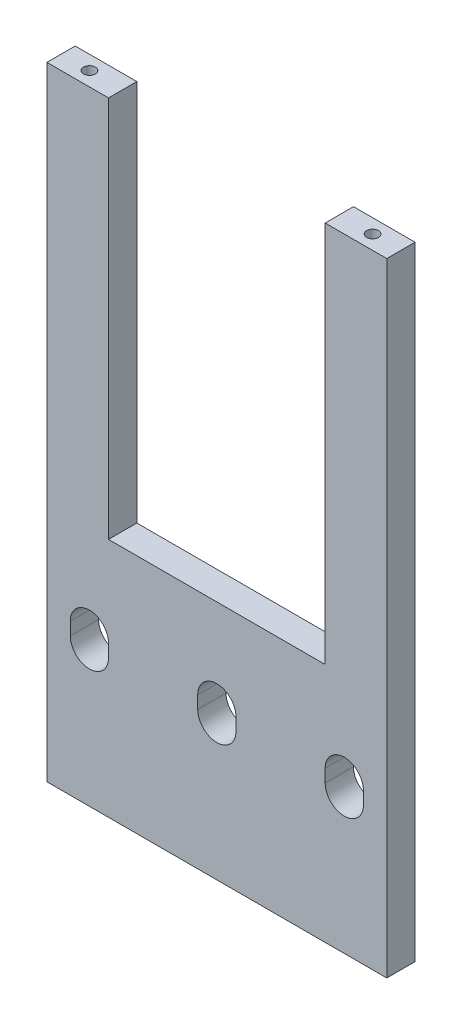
ISO-10303-21;
HEADER;
FILE_DESCRIPTION(('STEP AP214'),'2;1');
FILE_NAME('part.step','',(''),(''),'','','');
FILE_SCHEMA(('AUTOMOTIVE_DESIGN { 1 0 10303 214 1 1 1 1 }'));
ENDSEC;
DATA;
#1=APPLICATION_CONTEXT('core data for automotive mechanical design processes');
#2=APPLICATION_PROTOCOL_DEFINITION('international standard','automotive_design',2000,#1);
#3=PRODUCT_CONTEXT('',#1,'mechanical');
#4=PRODUCT('Part','Part','',(#3));
#5=PRODUCT_RELATED_PRODUCT_CATEGORY('part','',(#4));
#6=PRODUCT_DEFINITION_FORMATION('','',#4);
#7=PRODUCT_DEFINITION_CONTEXT('part definition',#1,'design');
#8=PRODUCT_DEFINITION('design','',#6,#7);
#9=PRODUCT_DEFINITION_SHAPE('','',#8);
#10=(LENGTH_UNIT() NAMED_UNIT(*) SI_UNIT(.MILLI.,.METRE.));
#11=(NAMED_UNIT(*) PLANE_ANGLE_UNIT() SI_UNIT($,.RADIAN.));
#12=(NAMED_UNIT(*) SI_UNIT($,.STERADIAN.) SOLID_ANGLE_UNIT());
#13=UNCERTAINTY_MEASURE_WITH_UNIT(LENGTH_MEASURE(1.E-05),#10,'distance_accuracy_value','');
#14=(GEOMETRIC_REPRESENTATION_CONTEXT(3) GLOBAL_UNCERTAINTY_ASSIGNED_CONTEXT((#13)) GLOBAL_UNIT_ASSIGNED_CONTEXT((#10,
#11,#12)) REPRESENTATION_CONTEXT('',''));
#15=CARTESIAN_POINT('',(0.,0.,0.));
#16=DIRECTION('',(0.,0.,1.));
#17=DIRECTION('',(1.,0.,0.));
#18=AXIS2_PLACEMENT_3D('',#15,#16,#17);
#19=CARTESIAN_POINT('',(60.,110.,10.));
#20=DIRECTION('',(0.,-1.,0.));
#21=DIRECTION('',(1.,0.,0.));
#22=AXIS2_PLACEMENT_3D('',#19,#20,#21);
#23=PLANE('',#22);
#24=CARTESIAN_POINT('',(-50.,110.,5.));
#25=DIRECTION('',(0.,1.,0.));
#26=DIRECTION('',(0.,0.,1.));
#27=AXIS2_PLACEMENT_3D('',#24,#25,#26);
#28=CIRCLE('',#27,2.1);
#29=CARTESIAN_POINT('',(-50.,110.,7.1));
#30=VERTEX_POINT('',#29);
#31=EDGE_CURVE('E436',#30,#30,#28,.T.);
#32=ORIENTED_EDGE('',*,*,#31,.F.);
#33=EDGE_LOOP('',(#32));
#34=FACE_BOUND('',#33,.T.);
#35=DIRECTION('',(-1.,0.,0.));
#36=VECTOR('',#35,1.);
#37=CARTESIAN_POINT('',(60.,110.,10.));
#38=LINE('',#37,#36);
#39=CARTESIAN_POINT('',(-38.25,110.,10.));
#40=VERTEX_POINT('',#39);
#41=CARTESIAN_POINT('',(-60.,110.,10.));
#42=VERTEX_POINT('',#41);
#43=EDGE_CURVE('E571',#40,#42,#38,.T.);
#44=ORIENTED_EDGE('',*,*,#43,.F.);
#45=DIRECTION('',(0.,0.,1.));
#46=VECTOR('',#45,1.);
#47=CARTESIAN_POINT('',(-38.25,110.,0.));
#48=LINE('',#47,#46);
#49=CARTESIAN_POINT('',(-38.25,110.,0.));
#50=VERTEX_POINT('',#49);
#51=EDGE_CURVE('E464',#50,#40,#48,.T.);
#52=ORIENTED_EDGE('',*,*,#51,.F.);
#53=DIRECTION('',(-1.,0.,0.));
#54=VECTOR('',#53,1.);
#55=CARTESIAN_POINT('',(60.,110.,0.));
#56=LINE('',#55,#54);
#57=CARTESIAN_POINT('',(-60.,110.,0.));
#58=VERTEX_POINT('',#57);
#59=EDGE_CURVE('E582',#50,#58,#56,.T.);
#60=ORIENTED_EDGE('',*,*,#59,.T.);
#61=DIRECTION('',(0.,0.,-1.));
#62=VECTOR('',#61,1.);
#63=CARTESIAN_POINT('',(-60.,110.,10.));
#64=LINE('',#63,#62);
#65=EDGE_CURVE('E575',#42,#58,#64,.T.);
#66=ORIENTED_EDGE('',*,*,#65,.F.);
#67=EDGE_LOOP('',(#44,#52,#60,#66));
#68=FACE_BOUND('',#67,.T.);
#69=ADVANCED_FACE('F259',(#34,#68),#23,.F.);
#70=CARTESIAN_POINT('',(0.,0.,10.));
#71=DIRECTION('',(0.,0.,-1.));
#72=DIRECTION('',(-1.,0.,0.));
#73=AXIS2_PLACEMENT_3D('',#70,#71,#72);
#74=PLANE('',#73);
#75=DIRECTION('',(1.,0.,0.));
#76=VECTOR('',#75,1.);
#77=CARTESIAN_POINT('',(-38.25,-25.,10.));
#78=LINE('',#77,#76);
#79=CARTESIAN_POINT('',(-38.25,-25.,10.));
#80=VERTEX_POINT('',#79);
#81=CARTESIAN_POINT('',(38.25,-25.,10.));
#82=VERTEX_POINT('',#81);
#83=EDGE_CURVE('E460',#80,#82,#78,.T.);
#84=ORIENTED_EDGE('',*,*,#83,.F.);
#85=DIRECTION('',(0.,-1.,0.));
#86=VECTOR('',#85,1.);
#87=CARTESIAN_POINT('',(-38.25,110.,10.));
#88=LINE('',#87,#86);
#89=EDGE_CURVE('E448',#40,#80,#88,.T.);
#90=ORIENTED_EDGE('',*,*,#89,.F.);
#91=ORIENTED_EDGE('',*,*,#43,.T.);
#92=DIRECTION('',(0.,-1.,0.));
#93=VECTOR('',#92,1.);
#94=CARTESIAN_POINT('',(-60.,110.,10.));
#95=LINE('',#94,#93);
#96=CARTESIAN_POINT('',(-60.,-110.,10.));
#97=VERTEX_POINT('',#96);
#98=EDGE_CURVE('E563',#42,#97,#95,.T.);
#99=ORIENTED_EDGE('',*,*,#98,.T.);
#100=DIRECTION('',(1.,0.,0.));
#101=VECTOR('',#100,1.);
#102=CARTESIAN_POINT('',(60.,-110.,10.));
#103=LINE('',#102,#101);
#104=CARTESIAN_POINT('',(60.,-110.,10.));
#105=VERTEX_POINT('',#104);
#106=EDGE_CURVE('E566',#97,#105,#103,.T.);
#107=ORIENTED_EDGE('',*,*,#106,.T.);
#108=DIRECTION('',(0.,1.,0.));
#109=VECTOR('',#108,1.);
#110=CARTESIAN_POINT('',(60.,110.,10.));
#111=LINE('',#110,#109);
#112=CARTESIAN_POINT('',(60.,110.,10.));
#113=VERTEX_POINT('',#112);
#114=EDGE_CURVE('E569',#105,#113,#111,.T.);
#115=ORIENTED_EDGE('',*,*,#114,.T.);
#116=CARTESIAN_POINT('',(38.25,110.,10.));
#117=VERTEX_POINT('',#116);
#118=EDGE_CURVE('E572',#113,#117,#38,.T.);
#119=ORIENTED_EDGE('',*,*,#118,.T.);
#120=DIRECTION('',(0.,1.,0.));
#121=VECTOR('',#120,1.);
#122=CARTESIAN_POINT('',(38.25,110.,10.));
#123=LINE('',#122,#121);
#124=EDGE_CURVE('E453',#82,#117,#123,.T.);
#125=ORIENTED_EDGE('',*,*,#124,.F.);
#126=EDGE_LOOP('',(#84,#90,#91,#99,#107,#115,#119,#125));
#127=FACE_BOUND('',#126,.T.);
#128=CARTESIAN_POINT('',(0.,-61.25,10.));
#129=DIRECTION('',(0.,0.,1.));
#130=DIRECTION('',(1.,0.,0.));
#131=AXIS2_PLACEMENT_3D('',#128,#129,#130);
#132=CIRCLE('',#131,6.75);
#133=CARTESIAN_POINT('',(-6.75000000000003,-61.25,10.));
#134=VERTEX_POINT('',#133);
#135=CARTESIAN_POINT('',(6.75000000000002,-61.25,10.));
#136=VERTEX_POINT('',#135);
#137=EDGE_CURVE('E544',#134,#136,#132,.T.);
#138=ORIENTED_EDGE('',*,*,#137,.F.);
#139=DIRECTION('',(0.,1.,0.));
#140=VECTOR('',#139,1.);
#141=CARTESIAN_POINT('',(-6.74999999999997,-61.25,10.));
#142=LINE('',#141,#140);
#143=CARTESIAN_POINT('',(-6.74999999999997,-56.75,10.));
#144=VERTEX_POINT('',#143);
#145=EDGE_CURVE('E538',#134,#144,#142,.T.);
#146=ORIENTED_EDGE('',*,*,#145,.T.);
#147=CARTESIAN_POINT('',(0.,-56.75,10.));
#148=DIRECTION('',(0.,0.,1.));
#149=DIRECTION('',(1.,0.,0.));
#150=AXIS2_PLACEMENT_3D('',#147,#148,#149);
#151=CIRCLE('',#150,6.75);
#152=CARTESIAN_POINT('',(6.75000000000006,-56.75,10.));
#153=VERTEX_POINT('',#152);
#154=EDGE_CURVE('E554',#153,#144,#151,.T.);
#155=ORIENTED_EDGE('',*,*,#154,.F.);
#156=DIRECTION('',(0.,1.,0.));
#157=VECTOR('',#156,1.);
#158=CARTESIAN_POINT('',(6.75000000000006,-61.25,10.));
#159=LINE('',#158,#157);
#160=EDGE_CURVE('E531',#136,#153,#159,.T.);
#161=ORIENTED_EDGE('',*,*,#160,.F.);
#162=EDGE_LOOP('',(#138,#146,#155,#161));
#163=FACE_BOUND('',#162,.T.);
#164=DIRECTION('',(0.,1.,0.));
#165=VECTOR('',#164,1.);
#166=CARTESIAN_POINT('',(38.25,-61.25,10.));
#167=LINE('',#166,#165);
#168=CARTESIAN_POINT('',(38.25,-61.25,10.));
#169=VERTEX_POINT('',#168);
#170=CARTESIAN_POINT('',(38.25,-56.75,10.));
#171=VERTEX_POINT('',#170);
#172=EDGE_CURVE('E507',#169,#171,#167,.T.);
#173=ORIENTED_EDGE('',*,*,#172,.T.);
#174=CARTESIAN_POINT('',(45.,-56.75,10.));
#175=DIRECTION('',(0.,0.,1.));
#176=DIRECTION('',(1.,0.,0.));
#177=AXIS2_PLACEMENT_3D('',#174,#175,#176);
#178=CIRCLE('',#177,6.75);
#179=CARTESIAN_POINT('',(51.75,-56.75,10.));
#180=VERTEX_POINT('',#179);
#181=EDGE_CURVE('E523',#180,#171,#178,.T.);
#182=ORIENTED_EDGE('',*,*,#181,.F.);
#183=DIRECTION('',(0.,1.,0.));
#184=VECTOR('',#183,1.);
#185=CARTESIAN_POINT('',(51.75,-61.25,10.));
#186=LINE('',#185,#184);
#187=CARTESIAN_POINT('',(51.75,-61.25,10.));
#188=VERTEX_POINT('',#187);
#189=EDGE_CURVE('E500',#188,#180,#186,.T.);
#190=ORIENTED_EDGE('',*,*,#189,.F.);
#191=CARTESIAN_POINT('',(45.,-61.25,10.));
#192=DIRECTION('',(0.,0.,1.));
#193=DIRECTION('',(1.,0.,0.));
#194=AXIS2_PLACEMENT_3D('',#191,#192,#193);
#195=CIRCLE('',#194,6.75);
#196=EDGE_CURVE('E513',#169,#188,#195,.T.);
#197=ORIENTED_EDGE('',*,*,#196,.F.);
#198=EDGE_LOOP('',(#173,#182,#190,#197));
#199=FACE_BOUND('',#198,.T.);
#200=CARTESIAN_POINT('',(-45.,-56.75,10.));
#201=DIRECTION('',(0.,0.,1.));
#202=DIRECTION('',(1.,0.,0.));
#203=AXIS2_PLACEMENT_3D('',#200,#201,#202);
#204=CIRCLE('',#203,6.75);
#205=CARTESIAN_POINT('',(-38.25,-56.75,10.));
#206=VERTEX_POINT('',#205);
#207=CARTESIAN_POINT('',(-51.75,-56.75,10.));
#208=VERTEX_POINT('',#207);
#209=EDGE_CURVE('E492',#206,#208,#204,.T.);
#210=ORIENTED_EDGE('',*,*,#209,.F.);
#211=DIRECTION('',(0.,1.,0.));
#212=VECTOR('',#211,1.);
#213=CARTESIAN_POINT('',(-38.25,-61.25,10.));
#214=LINE('',#213,#212);
#215=CARTESIAN_POINT('',(-38.25,-61.25,10.));
#216=VERTEX_POINT('',#215);
#217=EDGE_CURVE('E466',#216,#206,#214,.T.);
#218=ORIENTED_EDGE('',*,*,#217,.F.);
#219=CARTESIAN_POINT('',(-45.,-61.25,10.));
#220=DIRECTION('',(0.,0.,1.));
#221=DIRECTION('',(1.,0.,0.));
#222=AXIS2_PLACEMENT_3D('',#219,#220,#221);
#223=CIRCLE('',#222,6.75);
#224=CARTESIAN_POINT('',(-51.7499999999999,-61.25,10.));
#225=VERTEX_POINT('',#224);
#226=EDGE_CURVE('E483',#225,#216,#223,.T.);
#227=ORIENTED_EDGE('',*,*,#226,.F.);
#228=DIRECTION('',(0.,1.,0.));
#229=VECTOR('',#228,1.);
#230=CARTESIAN_POINT('',(-51.75,-61.25,10.));
#231=LINE('',#230,#229);
#232=EDGE_CURVE('E479',#225,#208,#231,.T.);
#233=ORIENTED_EDGE('',*,*,#232,.T.);
#234=EDGE_LOOP('',(#210,#218,#227,#233));
#235=FACE_BOUND('',#234,.T.);
#236=ADVANCED_FACE('F608',(#127,#163,#199,#235),#74,.F.);
#237=CARTESIAN_POINT('',(-60.,110.,10.));
#238=DIRECTION('',(1.,0.,0.));
#239=DIRECTION('',(0.,1.,0.));
#240=AXIS2_PLACEMENT_3D('',#237,#238,#239);
#241=PLANE('',#240);
#242=DIRECTION('',(0.,-1.,0.));
#243=VECTOR('',#242,1.);
#244=CARTESIAN_POINT('',(-60.,110.,0.));
#245=LINE('',#244,#243);
#246=CARTESIAN_POINT('',(-60.,-110.,0.));
#247=VERTEX_POINT('',#246);
#248=EDGE_CURVE('E562',#58,#247,#245,.T.);
#249=ORIENTED_EDGE('',*,*,#248,.T.);
#250=DIRECTION('',(0.,0.,-1.));
#251=VECTOR('',#250,1.);
#252=CARTESIAN_POINT('',(-60.,-110.,10.));
#253=LINE('',#252,#251);
#254=EDGE_CURVE('E13',#97,#247,#253,.T.);
#255=ORIENTED_EDGE('',*,*,#254,.F.);
#256=ORIENTED_EDGE('',*,*,#98,.F.);
#257=ORIENTED_EDGE('',*,*,#65,.T.);
#258=EDGE_LOOP('',(#249,#255,#256,#257));
#259=FACE_BOUND('',#258,.T.);
#260=ADVANCED_FACE('F261',(#259),#241,.F.);
#261=CARTESIAN_POINT('',(60.,-110.,10.));
#262=DIRECTION('',(0.,1.,0.));
#263=DIRECTION('',(0.,0.,1.));
#264=AXIS2_PLACEMENT_3D('',#261,#262,#263);
#265=PLANE('',#264);
#266=CARTESIAN_POINT('',(-50.,-110.,5.));
#267=DIRECTION('',(0.,-1.,0.));
#268=DIRECTION('',(0.,0.,-1.));
#269=AXIS2_PLACEMENT_3D('',#266,#267,#268);
#270=CIRCLE('',#269,2.1);
#271=CARTESIAN_POINT('',(-50.,-110.,2.9));
#272=VERTEX_POINT('',#271);
#273=EDGE_CURVE('E420',#272,#272,#270,.T.);
#274=ORIENTED_EDGE('',*,*,#273,.F.);
#275=EDGE_LOOP('',(#274));
#276=FACE_BOUND('',#275,.T.);
#277=CARTESIAN_POINT('',(40.,-110.,5.));
#278=DIRECTION('',(0.,-1.,0.));
#279=DIRECTION('',(0.,0.,-1.));
#280=AXIS2_PLACEMENT_3D('',#277,#278,#279);
#281=CIRCLE('',#280,2.1);
#282=CARTESIAN_POINT('',(40.,-110.,2.9));
#283=VERTEX_POINT('',#282);
#284=EDGE_CURVE('E419',#283,#283,#281,.T.);
#285=ORIENTED_EDGE('',*,*,#284,.F.);
#286=EDGE_LOOP('',(#285));
#287=FACE_BOUND('',#286,.T.);
#288=CARTESIAN_POINT('',(0.,-110.,5.));
#289=DIRECTION('',(0.,-1.,0.));
#290=DIRECTION('',(0.,0.,-1.));
#291=AXIS2_PLACEMENT_3D('',#288,#289,#290);
#292=CIRCLE('',#291,2.1);
#293=CARTESIAN_POINT('',(0.,-110.,2.9));
#294=VERTEX_POINT('',#293);
#295=EDGE_CURVE('E430',#294,#294,#292,.T.);
#296=ORIENTED_EDGE('',*,*,#295,.F.);
#297=EDGE_LOOP('',(#296));
#298=FACE_BOUND('',#297,.T.);
#299=DIRECTION('',(1.,0.,0.));
#300=VECTOR('',#299,1.);
#301=CARTESIAN_POINT('',(60.,-110.,0.));
#302=LINE('',#301,#300);
#303=CARTESIAN_POINT('',(60.,-110.,0.));
#304=VERTEX_POINT('',#303);
#305=EDGE_CURVE('E578',#247,#304,#302,.T.);
#306=ORIENTED_EDGE('',*,*,#305,.T.);
#307=DIRECTION('',(0.,0.,-1.));
#308=VECTOR('',#307,1.);
#309=CARTESIAN_POINT('',(60.,-110.,10.));
#310=LINE('',#309,#308);
#311=EDGE_CURVE('E267',#105,#304,#310,.T.);
#312=ORIENTED_EDGE('',*,*,#311,.F.);
#313=ORIENTED_EDGE('',*,*,#106,.F.);
#314=ORIENTED_EDGE('',*,*,#254,.T.);
#315=EDGE_LOOP('',(#306,#312,#313,#314));
#316=FACE_BOUND('',#315,.T.);
#317=ADVANCED_FACE('F612',(#276,#287,#298,#316),#265,.F.);
#318=CARTESIAN_POINT('',(60.,110.,10.));
#319=DIRECTION('',(-1.,0.,0.));
#320=DIRECTION('',(0.,-1.,0.));
#321=AXIS2_PLACEMENT_3D('',#318,#319,#320);
#322=PLANE('',#321);
#323=DIRECTION('',(0.,1.,0.));
#324=VECTOR('',#323,1.);
#325=CARTESIAN_POINT('',(60.,110.,0.));
#326=LINE('',#325,#324);
#327=CARTESIAN_POINT('',(60.,110.,0.));
#328=VERTEX_POINT('',#327);
#329=EDGE_CURVE('E580',#304,#328,#326,.T.);
#330=ORIENTED_EDGE('',*,*,#329,.T.);
#331=DIRECTION('',(0.,0.,-1.));
#332=VECTOR('',#331,1.);
#333=CARTESIAN_POINT('',(60.,110.,10.));
#334=LINE('',#333,#332);
#335=EDGE_CURVE('E587',#113,#328,#334,.T.);
#336=ORIENTED_EDGE('',*,*,#335,.F.);
#337=ORIENTED_EDGE('',*,*,#114,.F.);
#338=ORIENTED_EDGE('',*,*,#311,.T.);
#339=EDGE_LOOP('',(#330,#336,#337,#338));
#340=FACE_BOUND('',#339,.T.);
#341=ADVANCED_FACE('F594',(#340),#322,.F.);
#342=CARTESIAN_POINT('',(50.,110.,5.));
#343=DIRECTION('',(0.,1.,0.));
#344=DIRECTION('',(0.,0.,1.));
#345=AXIS2_PLACEMENT_3D('',#342,#343,#344);
#346=CIRCLE('',#345,2.1);
#347=CARTESIAN_POINT('',(50.,110.,7.1));
#348=VERTEX_POINT('',#347);
#349=EDGE_CURVE('E442',#348,#348,#346,.T.);
#350=ORIENTED_EDGE('',*,*,#349,.F.);
#351=EDGE_LOOP('',(#350));
#352=FACE_BOUND('',#351,.T.);
#353=CARTESIAN_POINT('',(38.25,110.,0.));
#354=VERTEX_POINT('',#353);
#355=EDGE_CURVE('E567',#328,#354,#56,.T.);
#356=ORIENTED_EDGE('',*,*,#355,.T.);
#357=DIRECTION('',(0.,0.,1.));
#358=VECTOR('',#357,1.);
#359=CARTESIAN_POINT('',(38.25,110.,0.));
#360=LINE('',#359,#358);
#361=EDGE_CURVE('E467',#354,#117,#360,.T.);
#362=ORIENTED_EDGE('',*,*,#361,.T.);
#363=ORIENTED_EDGE('',*,*,#118,.F.);
#364=ORIENTED_EDGE('',*,*,#335,.T.);
#365=EDGE_LOOP('',(#356,#362,#363,#364));
#366=FACE_BOUND('',#365,.T.);
#367=ADVANCED_FACE('F603',(#352,#366),#23,.F.);
#368=CARTESIAN_POINT('',(0.,0.,0.));
#369=DIRECTION('',(0.,0.,-1.));
#370=DIRECTION('',(-1.,0.,0.));
#371=AXIS2_PLACEMENT_3D('',#368,#369,#370);
#372=PLANE('',#371);
#373=DIRECTION('',(0.,-1.,0.));
#374=VECTOR('',#373,1.);
#375=CARTESIAN_POINT('',(-38.25,110.,0.));
#376=LINE('',#375,#374);
#377=CARTESIAN_POINT('',(-38.25,-25.,0.));
#378=VERTEX_POINT('',#377);
#379=EDGE_CURVE('E449',#50,#378,#376,.T.);
#380=ORIENTED_EDGE('',*,*,#379,.T.);
#381=DIRECTION('',(1.,0.,0.));
#382=VECTOR('',#381,1.);
#383=CARTESIAN_POINT('',(-38.25,-25.,0.));
#384=LINE('',#383,#382);
#385=CARTESIAN_POINT('',(38.25,-25.,0.));
#386=VERTEX_POINT('',#385);
#387=EDGE_CURVE('E452',#378,#386,#384,.T.);
#388=ORIENTED_EDGE('',*,*,#387,.T.);
#389=DIRECTION('',(0.,1.,0.));
#390=VECTOR('',#389,1.);
#391=CARTESIAN_POINT('',(38.25,110.,0.));
#392=LINE('',#391,#390);
#393=EDGE_CURVE('E274',#386,#354,#392,.T.);
#394=ORIENTED_EDGE('',*,*,#393,.T.);
#395=ORIENTED_EDGE('',*,*,#355,.F.);
#396=ORIENTED_EDGE('',*,*,#329,.F.);
#397=ORIENTED_EDGE('',*,*,#305,.F.);
#398=ORIENTED_EDGE('',*,*,#248,.F.);
#399=ORIENTED_EDGE('',*,*,#59,.F.);
#400=EDGE_LOOP('',(#380,#388,#394,#395,#396,#397,#398,#399));
#401=FACE_BOUND('',#400,.T.);
#402=DIRECTION('',(0.,1.,0.));
#403=VECTOR('',#402,1.);
#404=CARTESIAN_POINT('',(-51.75,-61.25,0.));
#405=LINE('',#404,#403);
#406=CARTESIAN_POINT('',(-51.75,-61.25,0.));
#407=VERTEX_POINT('',#406);
#408=CARTESIAN_POINT('',(-51.75,-56.75,0.));
#409=VERTEX_POINT('',#408);
#410=EDGE_CURVE('E477',#407,#409,#405,.T.);
#411=ORIENTED_EDGE('',*,*,#410,.F.);
#412=CARTESIAN_POINT('',(-45.,-61.25,0.));
#413=DIRECTION('',(0.,0.,1.));
#414=DIRECTION('',(1.,0.,0.));
#415=AXIS2_PLACEMENT_3D('',#412,#413,#414);
#416=CIRCLE('',#415,6.75);
#417=CARTESIAN_POINT('',(-38.25,-61.25,0.));
#418=VERTEX_POINT('',#417);
#419=EDGE_CURVE('E485',#407,#418,#416,.T.);
#420=ORIENTED_EDGE('',*,*,#419,.T.);
#421=DIRECTION('',(0.,1.,0.));
#422=VECTOR('',#421,1.);
#423=CARTESIAN_POINT('',(-38.25,-61.25,0.));
#424=LINE('',#423,#422);
#425=CARTESIAN_POINT('',(-38.25,-56.75,0.));
#426=VERTEX_POINT('',#425);
#427=EDGE_CURVE('E474',#418,#426,#424,.T.);
#428=ORIENTED_EDGE('',*,*,#427,.T.);
#429=CARTESIAN_POINT('',(-45.,-56.75,0.));
#430=DIRECTION('',(0.,0.,1.));
#431=DIRECTION('',(1.,0.,0.));
#432=AXIS2_PLACEMENT_3D('',#429,#430,#431);
#433=CIRCLE('',#432,6.75);
#434=EDGE_CURVE('E495',#426,#409,#433,.T.);
#435=ORIENTED_EDGE('',*,*,#434,.T.);
#436=EDGE_LOOP('',(#411,#420,#428,#435));
#437=FACE_BOUND('',#436,.T.);
#438=DIRECTION('',(0.,1.,0.));
#439=VECTOR('',#438,1.);
#440=CARTESIAN_POINT('',(38.25,-61.25,0.));
#441=LINE('',#440,#439);
#442=CARTESIAN_POINT('',(38.25,-61.25,0.));
#443=VERTEX_POINT('',#442);
#444=CARTESIAN_POINT('',(38.25,-56.75,0.));
#445=VERTEX_POINT('',#444);
#446=EDGE_CURVE('E505',#443,#445,#441,.T.);
#447=ORIENTED_EDGE('',*,*,#446,.F.);
#448=CARTESIAN_POINT('',(45.,-61.25,0.));
#449=DIRECTION('',(0.,0.,1.));
#450=DIRECTION('',(1.,0.,0.));
#451=AXIS2_PLACEMENT_3D('',#448,#449,#450);
#452=CIRCLE('',#451,6.75);
#453=CARTESIAN_POINT('',(51.75,-61.25,0.));
#454=VERTEX_POINT('',#453);
#455=EDGE_CURVE('E516',#443,#454,#452,.T.);
#456=ORIENTED_EDGE('',*,*,#455,.T.);
#457=DIRECTION('',(0.,1.,0.));
#458=VECTOR('',#457,1.);
#459=CARTESIAN_POINT('',(51.75,-61.25,0.));
#460=LINE('',#459,#458);
#461=CARTESIAN_POINT('',(51.75,-56.75,0.));
#462=VERTEX_POINT('',#461);
#463=EDGE_CURVE('E502',#454,#462,#460,.T.);
#464=ORIENTED_EDGE('',*,*,#463,.T.);
#465=CARTESIAN_POINT('',(45.,-56.75,0.));
#466=DIRECTION('',(0.,0.,1.));
#467=DIRECTION('',(1.,0.,0.));
#468=AXIS2_PLACEMENT_3D('',#465,#466,#467);
#469=CIRCLE('',#468,6.75);
#470=EDGE_CURVE('E526',#462,#445,#469,.T.);
#471=ORIENTED_EDGE('',*,*,#470,.T.);
#472=EDGE_LOOP('',(#447,#456,#464,#471));
#473=FACE_BOUND('',#472,.T.);
#474=CARTESIAN_POINT('',(0.,-56.75,0.));
#475=DIRECTION('',(0.,0.,1.));
#476=DIRECTION('',(1.,0.,0.));
#477=AXIS2_PLACEMENT_3D('',#474,#475,#476);
#478=CIRCLE('',#477,6.75);
#479=CARTESIAN_POINT('',(6.75000000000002,-56.75,0.));
#480=VERTEX_POINT('',#479);
#481=CARTESIAN_POINT('',(-6.74999999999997,-56.75,0.));
#482=VERTEX_POINT('',#481);
#483=EDGE_CURVE('E557',#480,#482,#478,.T.);
#484=ORIENTED_EDGE('',*,*,#483,.T.);
#485=DIRECTION('',(0.,1.,0.));
#486=VECTOR('',#485,1.);
#487=CARTESIAN_POINT('',(-6.74999999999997,-61.25,0.));
#488=LINE('',#487,#486);
#489=CARTESIAN_POINT('',(-6.74999999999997,-61.25,0.));
#490=VERTEX_POINT('',#489);
#491=EDGE_CURVE('E536',#490,#482,#488,.T.);
#492=ORIENTED_EDGE('',*,*,#491,.F.);
#493=CARTESIAN_POINT('',(0.,-61.25,0.));
#494=DIRECTION('',(0.,0.,1.));
#495=DIRECTION('',(1.,0.,0.));
#496=AXIS2_PLACEMENT_3D('',#493,#494,#495);
#497=CIRCLE('',#496,6.75);
#498=CARTESIAN_POINT('',(6.75000000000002,-61.25,0.));
#499=VERTEX_POINT('',#498);
#500=EDGE_CURVE('E547',#490,#499,#497,.T.);
#501=ORIENTED_EDGE('',*,*,#500,.T.);
#502=DIRECTION('',(0.,1.,0.));
#503=VECTOR('',#502,1.);
#504=CARTESIAN_POINT('',(6.75000000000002,-61.25,0.));
#505=LINE('',#504,#503);
#506=EDGE_CURVE('E533',#499,#480,#505,.T.);
#507=ORIENTED_EDGE('',*,*,#506,.T.);
#508=EDGE_LOOP('',(#484,#492,#501,#507));
#509=FACE_BOUND('',#508,.T.);
#510=ADVANCED_FACE('F599',(#401,#437,#473,#509),#372,.T.);
#511=CARTESIAN_POINT('',(0.,-56.75,10.));
#512=DIRECTION('',(0.,0.,1.));
#513=DIRECTION('',(1.,0.,0.));
#514=AXIS2_PLACEMENT_3D('',#511,#512,#513);
#515=CYLINDRICAL_SURFACE('',#514,6.75);
#516=ORIENTED_EDGE('',*,*,#483,.F.);
#517=DIRECTION('',(0.,0.,-1.));
#518=VECTOR('',#517,1.);
#519=CARTESIAN_POINT('',(6.75000000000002,-56.75,0.));
#520=LINE('',#519,#518);
#521=EDGE_CURVE('E552',#153,#480,#520,.T.);
#522=ORIENTED_EDGE('',*,*,#521,.F.);
#523=ORIENTED_EDGE('',*,*,#154,.T.);
#524=DIRECTION('',(0.,0.,1.));
#525=VECTOR('',#524,1.);
#526=CARTESIAN_POINT('',(-6.74999999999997,-56.75,10.));
#527=LINE('',#526,#525);
#528=EDGE_CURVE('E560',#482,#144,#527,.T.);
#529=ORIENTED_EDGE('',*,*,#528,.F.);
#530=EDGE_LOOP('',(#516,#522,#523,#529));
#531=FACE_BOUND('',#530,.T.);
#532=ADVANCED_FACE('F653',(#531),#515,.F.);
#533=CARTESIAN_POINT('',(0.,-61.25,10.));
#534=DIRECTION('',(0.,0.,1.));
#535=DIRECTION('',(1.,0.,0.));
#536=AXIS2_PLACEMENT_3D('',#533,#534,#535);
#537=CYLINDRICAL_SURFACE('',#536,6.75);
#538=ORIENTED_EDGE('',*,*,#137,.T.);
#539=DIRECTION('',(0.,0.,-1.));
#540=VECTOR('',#539,1.);
#541=CARTESIAN_POINT('',(6.75000000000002,-61.25,0.));
#542=LINE('',#541,#540);
#543=EDGE_CURVE('E541',#136,#499,#542,.T.);
#544=ORIENTED_EDGE('',*,*,#543,.T.);
#545=ORIENTED_EDGE('',*,*,#500,.F.);
#546=DIRECTION('',(0.,0.,1.));
#547=VECTOR('',#546,1.);
#548=CARTESIAN_POINT('',(-6.74999999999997,-61.25,10.));
#549=LINE('',#548,#547);
#550=EDGE_CURVE('E550',#134,#490,#549,.F.);
#551=ORIENTED_EDGE('',*,*,#550,.F.);
#552=EDGE_LOOP('',(#538,#544,#545,#551));
#553=FACE_BOUND('',#552,.T.);
#554=ADVANCED_FACE('F833',(#553),#537,.F.);
#555=CARTESIAN_POINT('',(-6.74999999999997,-61.25,10.));
#556=DIRECTION('',(-1.,0.,0.));
#557=DIRECTION('',(0.,0.,1.));
#558=AXIS2_PLACEMENT_3D('',#555,#556,#557);
#559=PLANE('',#558);
#560=ORIENTED_EDGE('',*,*,#528,.T.);
#561=ORIENTED_EDGE('',*,*,#145,.F.);
#562=ORIENTED_EDGE('',*,*,#550,.T.);
#563=ORIENTED_EDGE('',*,*,#491,.T.);
#564=EDGE_LOOP('',(#560,#561,#562,#563));
#565=FACE_BOUND('',#564,.T.);
#566=ADVANCED_FACE('F843',(#565),#559,.F.);
#567=CARTESIAN_POINT('',(6.75000000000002,-61.25,0.));
#568=DIRECTION('',(1.,0.,0.));
#569=DIRECTION('',(0.,0.,-1.));
#570=AXIS2_PLACEMENT_3D('',#567,#568,#569);
#571=PLANE('',#570);
#572=ORIENTED_EDGE('',*,*,#521,.T.);
#573=ORIENTED_EDGE('',*,*,#506,.F.);
#574=ORIENTED_EDGE('',*,*,#543,.F.);
#575=ORIENTED_EDGE('',*,*,#160,.T.);
#576=EDGE_LOOP('',(#572,#573,#574,#575));
#577=FACE_BOUND('',#576,.T.);
#578=ADVANCED_FACE('F853',(#577),#571,.F.);
#579=CARTESIAN_POINT('',(45.,-56.75,10.));
#580=DIRECTION('',(0.,0.,1.));
#581=DIRECTION('',(1.,0.,0.));
#582=AXIS2_PLACEMENT_3D('',#579,#580,#581);
#583=CYLINDRICAL_SURFACE('',#582,6.75);
#584=ORIENTED_EDGE('',*,*,#470,.F.);
#585=DIRECTION('',(0.,0.,-1.));
#586=VECTOR('',#585,1.);
#587=CARTESIAN_POINT('',(51.75,-56.75,0.));
#588=LINE('',#587,#586);
#589=EDGE_CURVE('E521',#180,#462,#588,.T.);
#590=ORIENTED_EDGE('',*,*,#589,.F.);
#591=ORIENTED_EDGE('',*,*,#181,.T.);
#592=DIRECTION('',(0.,0.,1.));
#593=VECTOR('',#592,1.);
#594=CARTESIAN_POINT('',(38.25,-56.75,10.));
#595=LINE('',#594,#593);
#596=EDGE_CURVE('E529',#445,#171,#595,.T.);
#597=ORIENTED_EDGE('',*,*,#596,.F.);
#598=EDGE_LOOP('',(#584,#590,#591,#597));
#599=FACE_BOUND('',#598,.T.);
#600=ADVANCED_FACE('F863',(#599),#583,.F.);
#601=CARTESIAN_POINT('',(45.,-61.25,10.));
#602=DIRECTION('',(0.,0.,1.));
#603=DIRECTION('',(1.,0.,0.));
#604=AXIS2_PLACEMENT_3D('',#601,#602,#603);
#605=CYLINDRICAL_SURFACE('',#604,6.75);
#606=ORIENTED_EDGE('',*,*,#196,.T.);
#607=DIRECTION('',(0.,0.,-1.));
#608=VECTOR('',#607,1.);
#609=CARTESIAN_POINT('',(51.75,-61.25,0.));
#610=LINE('',#609,#608);
#611=EDGE_CURVE('E510',#188,#454,#610,.T.);
#612=ORIENTED_EDGE('',*,*,#611,.T.);
#613=ORIENTED_EDGE('',*,*,#455,.F.);
#614=DIRECTION('',(0.,0.,1.));
#615=VECTOR('',#614,1.);
#616=CARTESIAN_POINT('',(38.25,-61.25,10.));
#617=LINE('',#616,#615);
#618=EDGE_CURVE('E519',#169,#443,#617,.F.);
#619=ORIENTED_EDGE('',*,*,#618,.F.);
#620=EDGE_LOOP('',(#606,#612,#613,#619));
#621=FACE_BOUND('',#620,.T.);
#622=ADVANCED_FACE('F873',(#621),#605,.F.);
#623=CARTESIAN_POINT('',(38.25,-61.25,10.));
#624=DIRECTION('',(-1.,0.,0.));
#625=DIRECTION('',(0.,0.,1.));
#626=AXIS2_PLACEMENT_3D('',#623,#624,#625);
#627=PLANE('',#626);
#628=ORIENTED_EDGE('',*,*,#596,.T.);
#629=ORIENTED_EDGE('',*,*,#172,.F.);
#630=ORIENTED_EDGE('',*,*,#618,.T.);
#631=ORIENTED_EDGE('',*,*,#446,.T.);
#632=EDGE_LOOP('',(#628,#629,#630,#631));
#633=FACE_BOUND('',#632,.T.);
#634=ADVANCED_FACE('F883',(#633),#627,.F.);
#635=CARTESIAN_POINT('',(51.75,-61.25,0.));
#636=DIRECTION('',(1.,0.,0.));
#637=DIRECTION('',(0.,0.,-1.));
#638=AXIS2_PLACEMENT_3D('',#635,#636,#637);
#639=PLANE('',#638);
#640=ORIENTED_EDGE('',*,*,#589,.T.);
#641=ORIENTED_EDGE('',*,*,#463,.F.);
#642=ORIENTED_EDGE('',*,*,#611,.F.);
#643=ORIENTED_EDGE('',*,*,#189,.T.);
#644=EDGE_LOOP('',(#640,#641,#642,#643));
#645=FACE_BOUND('',#644,.T.);
#646=ADVANCED_FACE('F893',(#645),#639,.F.);
#647=CARTESIAN_POINT('',(-45.,-56.75,10.));
#648=DIRECTION('',(0.,0.,1.));
#649=DIRECTION('',(1.,0.,0.));
#650=AXIS2_PLACEMENT_3D('',#647,#648,#649);
#651=CYLINDRICAL_SURFACE('',#650,6.75);
#652=ORIENTED_EDGE('',*,*,#434,.F.);
#653=DIRECTION('',(0.,0.,-1.));
#654=VECTOR('',#653,1.);
#655=CARTESIAN_POINT('',(-38.25,-56.75,0.));
#656=LINE('',#655,#654);
#657=EDGE_CURVE('E490',#206,#426,#656,.T.);
#658=ORIENTED_EDGE('',*,*,#657,.F.);
#659=ORIENTED_EDGE('',*,*,#209,.T.);
#660=DIRECTION('',(0.,0.,1.));
#661=VECTOR('',#660,1.);
#662=CARTESIAN_POINT('',(-51.75,-56.75,10.));
#663=LINE('',#662,#661);
#664=EDGE_CURVE('E498',#409,#208,#663,.T.);
#665=ORIENTED_EDGE('',*,*,#664,.F.);
#666=EDGE_LOOP('',(#652,#658,#659,#665));
#667=FACE_BOUND('',#666,.T.);
#668=ADVANCED_FACE('F903',(#667),#651,.F.);
#669=CARTESIAN_POINT('',(-45.,-61.25,10.));
#670=DIRECTION('',(0.,0.,1.));
#671=DIRECTION('',(1.,0.,0.));
#672=AXIS2_PLACEMENT_3D('',#669,#670,#671);
#673=CYLINDRICAL_SURFACE('',#672,6.75);
#674=ORIENTED_EDGE('',*,*,#226,.T.);
#675=DIRECTION('',(0.,0.,-1.));
#676=VECTOR('',#675,1.);
#677=CARTESIAN_POINT('',(-38.25,-61.25,0.));
#678=LINE('',#677,#676);
#679=EDGE_CURVE('E282',#216,#418,#678,.T.);
#680=ORIENTED_EDGE('',*,*,#679,.T.);
#681=ORIENTED_EDGE('',*,*,#419,.F.);
#682=DIRECTION('',(0.,0.,1.));
#683=VECTOR('',#682,1.);
#684=CARTESIAN_POINT('',(-51.75,-61.25,10.));
#685=LINE('',#684,#683);
#686=EDGE_CURVE('E488',#225,#407,#685,.F.);
#687=ORIENTED_EDGE('',*,*,#686,.F.);
#688=EDGE_LOOP('',(#674,#680,#681,#687));
#689=FACE_BOUND('',#688,.T.);
#690=ADVANCED_FACE('F913',(#689),#673,.F.);
#691=CARTESIAN_POINT('',(-51.75,-61.25,10.));
#692=DIRECTION('',(-1.,0.,0.));
#693=DIRECTION('',(0.,0.,1.));
#694=AXIS2_PLACEMENT_3D('',#691,#692,#693);
#695=PLANE('',#694);
#696=ORIENTED_EDGE('',*,*,#664,.T.);
#697=ORIENTED_EDGE('',*,*,#232,.F.);
#698=ORIENTED_EDGE('',*,*,#686,.T.);
#699=ORIENTED_EDGE('',*,*,#410,.T.);
#700=EDGE_LOOP('',(#696,#697,#698,#699));
#701=FACE_BOUND('',#700,.T.);
#702=ADVANCED_FACE('F922',(#701),#695,.F.);
#703=CARTESIAN_POINT('',(-38.25,-61.25,0.));
#704=DIRECTION('',(1.,0.,0.));
#705=DIRECTION('',(0.,0.,-1.));
#706=AXIS2_PLACEMENT_3D('',#703,#704,#705);
#707=PLANE('',#706);
#708=ORIENTED_EDGE('',*,*,#657,.T.);
#709=ORIENTED_EDGE('',*,*,#427,.F.);
#710=ORIENTED_EDGE('',*,*,#679,.F.);
#711=ORIENTED_EDGE('',*,*,#217,.T.);
#712=EDGE_LOOP('',(#708,#709,#710,#711));
#713=FACE_BOUND('',#712,.T.);
#714=ADVANCED_FACE('F634',(#713),#707,.F.);
#715=CARTESIAN_POINT('',(-38.25,110.,0.));
#716=DIRECTION('',(-1.,0.,0.));
#717=DIRECTION('',(0.,-1.,0.));
#718=AXIS2_PLACEMENT_3D('',#715,#716,#717);
#719=PLANE('',#718);
#720=ORIENTED_EDGE('',*,*,#89,.T.);
#721=DIRECTION('',(0.,0.,1.));
#722=VECTOR('',#721,1.);
#723=CARTESIAN_POINT('',(-38.25,-25.,0.));
#724=LINE('',#723,#722);
#725=EDGE_CURVE('E457',#378,#80,#724,.T.);
#726=ORIENTED_EDGE('',*,*,#725,.F.);
#727=ORIENTED_EDGE('',*,*,#379,.F.);
#728=ORIENTED_EDGE('',*,*,#51,.T.);
#729=EDGE_LOOP('',(#720,#726,#727,#728));
#730=FACE_BOUND('',#729,.T.);
#731=ADVANCED_FACE('F621',(#730),#719,.F.);
#732=CARTESIAN_POINT('',(38.25,110.,0.));
#733=DIRECTION('',(1.,0.,0.));
#734=DIRECTION('',(0.,1.,0.));
#735=AXIS2_PLACEMENT_3D('',#732,#733,#734);
#736=PLANE('',#735);
#737=ORIENTED_EDGE('',*,*,#124,.T.);
#738=ORIENTED_EDGE('',*,*,#361,.F.);
#739=ORIENTED_EDGE('',*,*,#393,.F.);
#740=DIRECTION('',(0.,0.,1.));
#741=VECTOR('',#740,1.);
#742=CARTESIAN_POINT('',(38.25,-25.,0.));
#743=LINE('',#742,#741);
#744=EDGE_CURVE('E470',#386,#82,#743,.T.);
#745=ORIENTED_EDGE('',*,*,#744,.T.);
#746=EDGE_LOOP('',(#737,#738,#739,#745));
#747=FACE_BOUND('',#746,.T.);
#748=ADVANCED_FACE('F625',(#747),#736,.F.);
#749=CARTESIAN_POINT('',(-38.25,-25.,0.));
#750=DIRECTION('',(0.,-1.,0.));
#751=DIRECTION('',(1.,0.,0.));
#752=AXIS2_PLACEMENT_3D('',#749,#750,#751);
#753=PLANE('',#752);
#754=ORIENTED_EDGE('',*,*,#83,.T.);
#755=ORIENTED_EDGE('',*,*,#744,.F.);
#756=ORIENTED_EDGE('',*,*,#387,.F.);
#757=ORIENTED_EDGE('',*,*,#725,.T.);
#758=EDGE_LOOP('',(#754,#755,#756,#757));
#759=FACE_BOUND('',#758,.T.);
#760=ADVANCED_FACE('F623',(#759),#753,.F.);
#761=CARTESIAN_POINT('',(50.,95.,5.));
#762=DIRECTION('',(0.,1.,0.));
#763=DIRECTION('',(0.,0.,1.));
#764=AXIS2_PLACEMENT_3D('',#761,#762,#763);
#765=CONICAL_SURFACE('',#764,2.1,1.02974425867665);
#766=CARTESIAN_POINT('',(50.,93.7381927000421,5.));
#767=VERTEX_POINT('',#766);
#768=VERTEX_LOOP('',#767);
#769=FACE_BOUND('',#768,.T.);
#770=CARTESIAN_POINT('',(50.,95.,5.));
#771=DIRECTION('',(0.,1.,0.));
#772=DIRECTION('',(0.,0.,1.));
#773=AXIS2_PLACEMENT_3D('',#770,#771,#772);
#774=CIRCLE('',#773,2.1);
#775=CARTESIAN_POINT('',(50.,95.,7.1));
#776=VERTEX_POINT('',#775);
#777=EDGE_CURVE('E445',#776,#776,#774,.T.);
#778=ORIENTED_EDGE('',*,*,#777,.T.);
#779=EDGE_LOOP('',(#778));
#780=FACE_BOUND('',#779,.T.);
#781=ADVANCED_FACE('F632',(#769,#780),#765,.F.);
#782=CARTESIAN_POINT('',(50.,110.,5.));
#783=DIRECTION('',(0.,1.,0.));
#784=DIRECTION('',(0.,0.,1.));
#785=AXIS2_PLACEMENT_3D('',#782,#783,#784);
#786=CYLINDRICAL_SURFACE('',#785,2.1);
#787=ORIENTED_EDGE('',*,*,#777,.F.);
#788=EDGE_LOOP('',(#787));
#789=FACE_BOUND('',#788,.T.);
#790=ORIENTED_EDGE('',*,*,#349,.T.);
#791=EDGE_LOOP('',(#790));
#792=FACE_BOUND('',#791,.T.);
#793=ADVANCED_FACE('F656',(#789,#792),#786,.F.);
#794=CARTESIAN_POINT('',(-50.,95.,5.));
#795=DIRECTION('',(0.,1.,0.));
#796=DIRECTION('',(0.,0.,1.));
#797=AXIS2_PLACEMENT_3D('',#794,#795,#796);
#798=CONICAL_SURFACE('',#797,2.1,1.02974425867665);
#799=CARTESIAN_POINT('',(-50.,93.7381927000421,5.));
#800=VERTEX_POINT('',#799);
#801=VERTEX_LOOP('',#800);
#802=FACE_BOUND('',#801,.T.);
#803=CARTESIAN_POINT('',(-50.,95.,5.));
#804=DIRECTION('',(0.,1.,0.));
#805=DIRECTION('',(0.,0.,1.));
#806=AXIS2_PLACEMENT_3D('',#803,#804,#805);
#807=CIRCLE('',#806,2.1);
#808=CARTESIAN_POINT('',(-50.,95.,7.1));
#809=VERTEX_POINT('',#808);
#810=EDGE_CURVE('E439',#809,#809,#807,.T.);
#811=ORIENTED_EDGE('',*,*,#810,.T.);
#812=EDGE_LOOP('',(#811));
#813=FACE_BOUND('',#812,.T.);
#814=ADVANCED_FACE('F658',(#802,#813),#798,.F.);
#815=CARTESIAN_POINT('',(-50.,110.,5.));
#816=DIRECTION('',(0.,1.,0.));
#817=DIRECTION('',(0.,0.,1.));
#818=AXIS2_PLACEMENT_3D('',#815,#816,#817);
#819=CYLINDRICAL_SURFACE('',#818,2.1);
#820=ORIENTED_EDGE('',*,*,#810,.F.);
#821=EDGE_LOOP('',(#820));
#822=FACE_BOUND('',#821,.T.);
#823=ORIENTED_EDGE('',*,*,#31,.T.);
#824=EDGE_LOOP('',(#823));
#825=FACE_BOUND('',#824,.T.);
#826=ADVANCED_FACE('F665',(#822,#825),#819,.F.);
#827=CARTESIAN_POINT('',(0.,-95.,5.));
#828=DIRECTION('',(0.,-1.,0.));
#829=DIRECTION('',(0.,0.,-1.));
#830=AXIS2_PLACEMENT_3D('',#827,#828,#829);
#831=CONICAL_SURFACE('',#830,2.1,1.02974425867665);
#832=CARTESIAN_POINT('',(0.,-93.7381927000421,5.));
#833=VERTEX_POINT('',#832);
#834=VERTEX_LOOP('',#833);
#835=FACE_BOUND('',#834,.T.);
#836=CARTESIAN_POINT('',(0.,-95.,5.));
#837=DIRECTION('',(0.,-1.,0.));
#838=DIRECTION('',(0.,0.,-1.));
#839=AXIS2_PLACEMENT_3D('',#836,#837,#838);
#840=CIRCLE('',#839,2.1);
#841=CARTESIAN_POINT('',(0.,-95.,2.9));
#842=VERTEX_POINT('',#841);
#843=EDGE_CURVE('E433',#842,#842,#840,.T.);
#844=ORIENTED_EDGE('',*,*,#843,.T.);
#845=EDGE_LOOP('',(#844));
#846=FACE_BOUND('',#845,.T.);
#847=ADVANCED_FACE('F673',(#835,#846),#831,.F.);
#848=CARTESIAN_POINT('',(0.,-110.,5.));
#849=DIRECTION('',(0.,-1.,0.));
#850=DIRECTION('',(0.,0.,-1.));
#851=AXIS2_PLACEMENT_3D('',#848,#849,#850);
#852=CYLINDRICAL_SURFACE('',#851,2.1);
#853=ORIENTED_EDGE('',*,*,#843,.F.);
#854=EDGE_LOOP('',(#853));
#855=FACE_BOUND('',#854,.T.);
#856=ORIENTED_EDGE('',*,*,#295,.T.);
#857=EDGE_LOOP('',(#856));
#858=FACE_BOUND('',#857,.T.);
#859=ADVANCED_FACE('F677',(#855,#858),#852,.F.);
#860=CARTESIAN_POINT('',(40.,-95.,5.));
#861=DIRECTION('',(0.,-1.,0.));
#862=DIRECTION('',(0.,0.,-1.));
#863=AXIS2_PLACEMENT_3D('',#860,#861,#862);
#864=CONICAL_SURFACE('',#863,2.1,1.02974425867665);
#865=CARTESIAN_POINT('',(40.,-93.7381927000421,5.));
#866=VERTEX_POINT('',#865);
#867=VERTEX_LOOP('',#866);
#868=FACE_BOUND('',#867,.T.);
#869=CARTESIAN_POINT('',(40.,-95.,5.));
#870=DIRECTION('',(0.,-1.,0.));
#871=DIRECTION('',(0.,0.,-1.));
#872=AXIS2_PLACEMENT_3D('',#869,#870,#871);
#873=CIRCLE('',#872,2.1);
#874=CARTESIAN_POINT('',(40.,-95.,2.9));
#875=VERTEX_POINT('',#874);
#876=EDGE_CURVE('E423',#875,#875,#873,.T.);
#877=ORIENTED_EDGE('',*,*,#876,.T.);
#878=EDGE_LOOP('',(#877));
#879=FACE_BOUND('',#878,.T.);
#880=ADVANCED_FACE('F681',(#868,#879),#864,.F.);
#881=CARTESIAN_POINT('',(40.,-110.,5.));
#882=DIRECTION('',(0.,-1.,0.));
#883=DIRECTION('',(0.,0.,-1.));
#884=AXIS2_PLACEMENT_3D('',#881,#882,#883);
#885=CYLINDRICAL_SURFACE('',#884,2.1);
#886=ORIENTED_EDGE('',*,*,#876,.F.);
#887=EDGE_LOOP('',(#886));
#888=FACE_BOUND('',#887,.T.);
#889=ORIENTED_EDGE('',*,*,#284,.T.);
#890=EDGE_LOOP('',(#889));
#891=FACE_BOUND('',#890,.T.);
#892=ADVANCED_FACE('F413',(#888,#891),#885,.F.);
#893=CARTESIAN_POINT('',(-50.,-95.,5.));
#894=DIRECTION('',(0.,-1.,0.));
#895=DIRECTION('',(0.,0.,-1.));
#896=AXIS2_PLACEMENT_3D('',#893,#894,#895);
#897=CONICAL_SURFACE('',#896,2.1,1.02974425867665);
#898=CARTESIAN_POINT('',(-50.,-93.7381927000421,5.));
#899=VERTEX_POINT('',#898);
#900=VERTEX_LOOP('',#899);
#901=FACE_BOUND('',#900,.T.);
#902=CARTESIAN_POINT('',(-50.,-95.,5.));
#903=DIRECTION('',(0.,-1.,0.));
#904=DIRECTION('',(0.,0.,-1.));
#905=AXIS2_PLACEMENT_3D('',#902,#903,#904);
#906=CIRCLE('',#905,2.1);
#907=CARTESIAN_POINT('',(-50.,-95.,2.9));
#908=VERTEX_POINT('',#907);
#909=EDGE_CURVE('E417',#908,#908,#906,.T.);
#910=ORIENTED_EDGE('',*,*,#909,.T.);
#911=EDGE_LOOP('',(#910));
#912=FACE_BOUND('',#911,.T.);
#913=ADVANCED_FACE('F409',(#901,#912),#897,.F.);
#914=CARTESIAN_POINT('',(-50.,-110.,5.));
#915=DIRECTION('',(0.,-1.,0.));
#916=DIRECTION('',(0.,0.,-1.));
#917=AXIS2_PLACEMENT_3D('',#914,#915,#916);
#918=CYLINDRICAL_SURFACE('',#917,2.1);
#919=ORIENTED_EDGE('',*,*,#909,.F.);
#920=EDGE_LOOP('',(#919));
#921=FACE_BOUND('',#920,.T.);
#922=ORIENTED_EDGE('',*,*,#273,.T.);
#923=EDGE_LOOP('',(#922));
#924=FACE_BOUND('',#923,.T.);
#925=ADVANCED_FACE('F412',(#921,#924),#918,.F.);
#926=CLOSED_SHELL('',(#69,#236,#260,#317,#341,#367,#510,#532,#554,#566,#578,#600,#622,#634,#646,
#668,#690,#702,#714,#731,#748,#760,#781,#793,#814,#826,#847,#859,#880,#892,#913,#925));
#927=MANIFOLD_SOLID_BREP('B2',#926);
#928=ADVANCED_BREP_SHAPE_REPRESENTATION('',(#18,#927),#14);
#929=SHAPE_DEFINITION_REPRESENTATION(#9,#928);
ENDSEC;
END-ISO-10303-21;
